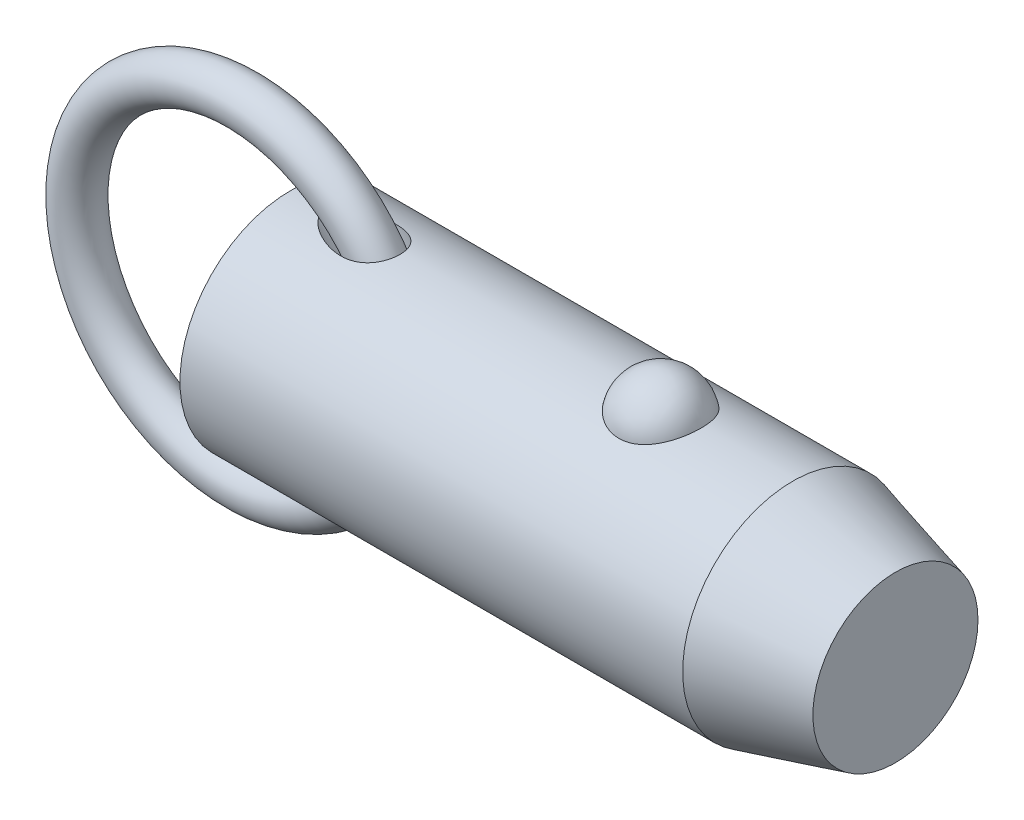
ISO-10303-21;
HEADER;
FILE_DESCRIPTION(('STEP AP214'),'2;1');
FILE_NAME('part.step','',(''),(''),'','','');
FILE_SCHEMA(('AUTOMOTIVE_DESIGN { 1 0 10303 214 1 1 1 1 }'));
ENDSEC;
DATA;
#1=APPLICATION_CONTEXT('core data for automotive mechanical design processes');
#2=APPLICATION_PROTOCOL_DEFINITION('international standard','automotive_design',2000,#1);
#3=PRODUCT_CONTEXT('',#1,'mechanical');
#4=PRODUCT('Part','Part','',(#3));
#5=PRODUCT_RELATED_PRODUCT_CATEGORY('part','',(#4));
#6=PRODUCT_DEFINITION_FORMATION('','',#4);
#7=PRODUCT_DEFINITION_CONTEXT('part definition',#1,'design');
#8=PRODUCT_DEFINITION('design','',#6,#7);
#9=PRODUCT_DEFINITION_SHAPE('','',#8);
#10=(LENGTH_UNIT() NAMED_UNIT(*) SI_UNIT(.MILLI.,.METRE.));
#11=(NAMED_UNIT(*) PLANE_ANGLE_UNIT() SI_UNIT($,.RADIAN.));
#12=(NAMED_UNIT(*) SI_UNIT($,.STERADIAN.) SOLID_ANGLE_UNIT());
#13=UNCERTAINTY_MEASURE_WITH_UNIT(LENGTH_MEASURE(1.E-05),#10,'distance_accuracy_value','');
#14=(GEOMETRIC_REPRESENTATION_CONTEXT(3) GLOBAL_UNCERTAINTY_ASSIGNED_CONTEXT((#13)) GLOBAL_UNIT_ASSIGNED_CONTEXT((#10,
#11,#12)) REPRESENTATION_CONTEXT('',''));
#15=CARTESIAN_POINT('',(0.,0.,0.));
#16=DIRECTION('',(0.,0.,1.));
#17=DIRECTION('',(1.,0.,0.));
#18=AXIS2_PLACEMENT_3D('',#15,#16,#17);
#19=CARTESIAN_POINT('',(-5.53898640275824,0.,0.));
#20=DIRECTION('',(0.,0.,1.));
#21=DIRECTION('',(1.,0.,0.));
#22=AXIS2_PLACEMENT_3D('',#19,#20,#21);
#23=TOROIDAL_SURFACE('',#22,19.05,2.54);
#24=CARTESIAN_POINT('',(16.0510135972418,0.,0.));
#25=VERTEX_POINT('',#24);
#26=VERTEX_LOOP('',#25);
#27=FACE_BOUND('',#26,.T.);
#28=ADVANCED_FACE('P0_F12',(#27),#23,.T.);
#29=CLOSED_SHELL('',(#28));
#30=MANIFOLD_SOLID_BREP('P0_B1',#29);
#31=CARTESIAN_POINT('',(0.,0.,0.));
#32=DIRECTION('',(1.,0.,0.));
#33=DIRECTION('',(0.,0.,-1.));
#34=AXIS2_PLACEMENT_3D('',#31,#32,#33);
#35=CYLINDRICAL_SURFACE('',#34,12.7);
#36=CARTESIAN_POINT('',(58.0007386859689,0.,0.));
#37=DIRECTION('',(1.,0.,0.));
#38=DIRECTION('',(0.,0.,-1.));
#39=AXIS2_PLACEMENT_3D('',#36,#37,#38);
#40=CIRCLE('',#39,12.7);
#41=CARTESIAN_POINT('',(58.0007386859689,0.,-12.7));
#42=VERTEX_POINT('',#41);
#43=EDGE_CURVE('P1_E89',#42,#42,#40,.T.);
#44=ORIENTED_EDGE('',*,*,#43,.F.);
#45=EDGE_LOOP('',(#44));
#46=FACE_BOUND('',#45,.T.);
#47=CARTESIAN_POINT('',(0.,0.,0.));
#48=DIRECTION('',(1.,0.,0.));
#49=DIRECTION('',(0.,0.,-1.));
#50=AXIS2_PLACEMENT_3D('',#47,#48,#49);
#51=CIRCLE('',#50,12.7);
#52=CARTESIAN_POINT('',(0.,0.,-12.7));
#53=VERTEX_POINT('',#52);
#54=EDGE_CURVE('P1_E52',#53,#53,#51,.T.);
#55=ORIENTED_EDGE('',*,*,#54,.T.);
#56=EDGE_LOOP('',(#55));
#57=FACE_BOUND('',#56,.T.);
#58=CARTESIAN_POINT('',(42.7600429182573,11.7500437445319,4.81938502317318));
#59=CARTESIAN_POINT('',(42.6350881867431,11.7500430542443,4.81938571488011));
#60=CARTESIAN_POINT('',(42.510144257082,11.7520975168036,4.81438658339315));
#61=CARTESIAN_POINT('',(42.2611425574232,11.760253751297,4.79442904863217));
#62=CARTESIAN_POINT('',(42.1370850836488,11.7663568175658,4.77946746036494));
#63=CARTESIAN_POINT('',(41.8909016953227,11.7824262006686,4.73971414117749));
#64=CARTESIAN_POINT('',(41.7687744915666,11.7923898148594,4.71492928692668));
#65=CARTESIAN_POINT('',(41.5271874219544,11.8158938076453,4.65571340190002));
#66=CARTESIAN_POINT('',(41.4077285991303,11.8294355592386,4.6212786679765));
#67=CARTESIAN_POINT('',(41.1725578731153,11.8596812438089,4.54309502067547));
#68=CARTESIAN_POINT('',(41.0568393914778,11.8763792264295,4.49936361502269));
#69=CARTESIAN_POINT('',(40.8296530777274,11.9124878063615,4.40287235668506));
#70=CARTESIAN_POINT('',(40.7181868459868,11.9318994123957,4.35010914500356));
#71=CARTESIAN_POINT('',(40.3912782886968,11.9934256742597,4.17881316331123));
#72=CARTESIAN_POINT('',(40.1831270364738,12.038858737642,4.04720756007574));
#73=CARTESIAN_POINT('',(39.7858509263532,12.1352173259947,3.748564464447));
#74=CARTESIAN_POINT('',(39.5974438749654,12.1862630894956,3.58061821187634));
#75=CARTESIAN_POINT('',(39.2505213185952,12.2875163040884,3.21600758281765));
#76=CARTESIAN_POINT('',(39.0920113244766,12.3377235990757,3.0193379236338));
#77=CARTESIAN_POINT('',(38.8016887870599,12.434492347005,2.592916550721));
#78=CARTESIAN_POINT('',(38.6713762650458,12.4807925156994,2.36208286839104));
#79=CARTESIAN_POINT('',(38.4494079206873,12.5623454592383,1.88070399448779));
#80=CARTESIAN_POINT('',(38.3577554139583,12.5975972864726,1.63015711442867));
#81=CARTESIAN_POINT('',(38.2140466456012,12.6538414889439,1.11298869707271));
#82=CARTESIAN_POINT('',(38.1624990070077,12.6746503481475,0.846205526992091));
#83=CARTESIAN_POINT('',(38.1019771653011,12.699153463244,0.307085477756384));
#84=CARTESIAN_POINT('',(38.0930018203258,12.7028481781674,0.0347487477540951));
#85=CARTESIAN_POINT('',(38.1177310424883,12.6927785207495,-0.506073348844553));
#86=CARTESIAN_POINT('',(38.1511899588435,12.6791146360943,-0.774571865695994));
#87=CARTESIAN_POINT('',(38.2596877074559,12.635882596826,-1.30170246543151));
#88=CARTESIAN_POINT('',(38.3347272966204,12.606314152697,-1.5603343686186));
#89=CARTESIAN_POINT('',(38.5250000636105,12.5342328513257,-2.06083899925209));
#90=CARTESIAN_POINT('',(38.6402872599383,12.4917026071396,-2.3026886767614));
#91=CARTESIAN_POINT('',(38.9087044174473,12.3981123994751,-2.76259600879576));
#92=CARTESIAN_POINT('',(39.0618374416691,12.3470517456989,-2.98065173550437));
#93=CARTESIAN_POINT('',(39.4035077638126,12.2416045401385,-3.38786328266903));
#94=CARTESIAN_POINT('',(39.5922017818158,12.1872040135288,-3.57688418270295));
#95=CARTESIAN_POINT('',(40.0002392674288,12.0814086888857,-3.91941073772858));
#96=CARTESIAN_POINT('',(40.2195800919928,12.0300136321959,-4.07291945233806));
#97=CARTESIAN_POINT('',(40.6783753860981,11.9373542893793,-4.33691289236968));
#98=CARTESIAN_POINT('',(40.9173044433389,11.8958982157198,-4.44824125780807));
#99=CARTESIAN_POINT('',(41.4124376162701,11.8268116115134,-4.62881985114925));
#100=CARTESIAN_POINT('',(41.6686351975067,11.7991758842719,-4.69808589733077));
#101=CARTESIAN_POINT('',(42.1771640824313,11.7622209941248,-4.78983181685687));
#102=CARTESIAN_POINT('',(42.4290414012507,11.7520502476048,-4.81449025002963));
#103=CARTESIAN_POINT('',(42.9335734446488,11.7485796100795,-4.82295735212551));
#104=CARTESIAN_POINT('',(43.1862280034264,11.7552763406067,-4.80677420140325));
#105=CARTESIAN_POINT('',(43.6768341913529,11.7842584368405,-4.73525430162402));
#106=CARTESIAN_POINT('',(43.9149984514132,11.8060486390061,-4.68116061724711));
#107=CARTESIAN_POINT('',(44.3784894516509,11.8622750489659,-4.53678133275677));
#108=CARTESIAN_POINT('',(44.6038151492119,11.8967122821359,-4.44649279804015));
#109=CARTESIAN_POINT('',(45.0408018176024,11.9754603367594,-4.2298761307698));
#110=CARTESIAN_POINT('',(45.2520579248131,12.0199699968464,-4.10280539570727));
#111=CARTESIAN_POINT('',(45.6506012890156,12.1138028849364,-3.81685409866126));
#112=CARTESIAN_POINT('',(45.8378830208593,12.163127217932,-3.65796622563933));
#113=CARTESIAN_POINT('',(46.1933509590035,12.2642343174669,-3.30364864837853));
#114=CARTESIAN_POINT('',(46.3601119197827,12.3160165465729,-3.10678783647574));
#115=CARTESIAN_POINT('',(46.6595799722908,12.4142566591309,-2.68748409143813));
#116=CARTESIAN_POINT('',(46.7922809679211,12.4607135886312,-2.46503658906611));
#117=CARTESIAN_POINT('',(47.0246912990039,12.5450236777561,-1.9928951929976));
#118=CARTESIAN_POINT('',(47.123215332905,12.5825557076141,-1.7425591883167));
#119=CARTESIAN_POINT('',(47.2792277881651,12.6431720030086,-1.22773734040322));
#120=CARTESIAN_POINT('',(47.3367157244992,12.6662560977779,-0.963251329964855));
#121=CARTESIAN_POINT('',(47.4095441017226,12.6956486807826,-0.427355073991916));
#122=CARTESIAN_POINT('',(47.4248378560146,12.7019385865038,-0.155937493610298));
#123=CARTESIAN_POINT('',(47.4127794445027,12.6970201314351,0.385928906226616));
#124=CARTESIAN_POINT('',(47.3854280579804,12.6858120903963,0.656377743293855));
#125=CARTESIAN_POINT('',(47.3130609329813,12.6568455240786,1.05454017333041));
#126=CARTESIAN_POINT('',(47.2837963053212,12.6451962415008,1.18577850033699));
#127=CARTESIAN_POINT('',(47.2150228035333,12.6181819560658,1.44513808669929));
#128=CARTESIAN_POINT('',(47.1755176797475,12.6028183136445,1.57326046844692));
#129=CARTESIAN_POINT('',(47.0864397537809,12.5687547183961,1.82554978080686));
#130=CARTESIAN_POINT('',(47.0368627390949,12.5500533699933,1.9497150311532));
#131=CARTESIAN_POINT('',(46.9279211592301,12.5098093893,2.19314370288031));
#132=CARTESIAN_POINT('',(46.8685601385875,12.4882677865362,2.31240887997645));
#133=CARTESIAN_POINT('',(46.7399712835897,12.4427679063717,2.54593031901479));
#134=CARTESIAN_POINT('',(46.6706888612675,12.4187964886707,2.66015396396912));
#135=CARTESIAN_POINT('',(46.522903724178,12.3691892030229,2.88202659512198));
#136=CARTESIAN_POINT('',(46.4444044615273,12.3435539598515,2.98967802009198));
#137=CARTESIAN_POINT('',(46.2785502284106,12.2912955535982,3.19774385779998));
#138=CARTESIAN_POINT('',(46.1911918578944,12.2646720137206,3.29815546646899));
#139=CARTESIAN_POINT('',(46.0081617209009,12.2111945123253,3.49095035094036));
#140=CARTESIAN_POINT('',(45.9124932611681,12.1843406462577,3.58333679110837));
#141=CARTESIAN_POINT('',(45.7136272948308,12.1312249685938,3.75922876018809));
#142=CARTESIAN_POINT('',(45.6104503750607,12.104961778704,3.84275713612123));
#143=CARTESIAN_POINT('',(45.3970133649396,12.0537284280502,4.00056406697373));
#144=CARTESIAN_POINT('',(45.2867562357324,12.028757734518,4.07484645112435));
#145=CARTESIAN_POINT('',(45.0597550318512,11.9808306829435,4.21367959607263));
#146=CARTESIAN_POINT('',(44.9430068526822,11.9578756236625,4.27822410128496));
#147=CARTESIAN_POINT('',(44.7039425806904,11.9147184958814,4.39698483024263));
#148=CARTESIAN_POINT('',(44.5816287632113,11.894515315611,4.45120522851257));
#149=CARTESIAN_POINT('',(44.322952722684,11.8561129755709,4.55255353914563));
#150=CARTESIAN_POINT('',(44.1862237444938,11.8381764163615,4.59884858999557));
#151=CARTESIAN_POINT('',(43.9086087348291,11.8069093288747,4.67853897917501));
#152=CARTESIAN_POINT('',(43.7677245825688,11.7935767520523,4.71194005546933));
#153=CARTESIAN_POINT('',(43.4830944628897,11.7720277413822,4.76552188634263));
#154=CARTESIAN_POINT('',(43.3393488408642,11.7638106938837,4.78570422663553));
#155=CARTESIAN_POINT('',(43.0504114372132,11.7528195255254,4.81263433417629));
#156=CARTESIAN_POINT('',(42.9052198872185,11.7500445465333,4.81938421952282));
#157=CARTESIAN_POINT('',(42.7600429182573,11.7500437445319,4.81938502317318));
#158=B_SPLINE_CURVE_WITH_KNOTS('',3,(#58,#59,#60,#61,#62,#63,#64,#65,#66,#67,#68,#69,#70,#71,
#72,#73,#74,#75,#76,#77,#78,#79,#80,#81,#82,#83,#84,#85,#86,#87,#88,#89,#90,#91,#92,#93,#94,#95,
#96,#97,#98,#99,#100,#101,#102,#103,#104,#105,#106,#107,#108,#109,#110,#111,#112,#113,#114,#115,
#116,#117,#118,#119,#120,#121,#122,#123,#124,#125,#126,#127,#128,#129,#130,#131,#132,#133,#134,
#135,#136,#137,#138,#139,#140,#141,#142,#143,#144,#145,#146,#147,#148,#149,#150,#151,#152,#153,
#154,#155,#156,#157),.UNSPECIFIED.,.T.,.F.,(4,2,2,2,2,2,2,2,2,2,2,2,2,2,2,2,2,2,2,2,2,2,2,2,2,2,
2,2,2,2,2,2,2,2,2,2,2,2,2,2,2,2,2,2,2,2,2,2,2,4),(0.,0.374729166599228,0.749578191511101,
1.12416526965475,1.49889629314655,1.87292776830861,2.24709865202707,2.99481328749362,
3.76399449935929,4.53331735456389,5.3368391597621,6.14042986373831,6.95405296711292,
7.76765424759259,8.57656703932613,9.38549455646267,10.1955119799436,11.0055949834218,
11.8193353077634,12.6330054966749,13.4294141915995,14.2255231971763,14.9815786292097,
15.7374826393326,16.4696948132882,17.2019663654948,17.9501979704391,18.6986017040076,
19.4844704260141,20.2704797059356,21.0815215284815,21.8925729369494,22.7045213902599,
23.5164550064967,23.9209608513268,24.3253187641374,24.7298461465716,25.1342272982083,
25.54092555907,25.9474719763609,26.3541750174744,26.7607169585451,27.1661834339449,
27.5714814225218,27.9770386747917,28.3824315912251,28.8181206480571,29.2536155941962,
29.6890582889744,30.1244323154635),.UNSPECIFIED.);
#159=CARTESIAN_POINT('',(42.7600429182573,11.7500437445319,4.81938502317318));
#160=VERTEX_POINT('',#159);
#161=EDGE_CURVE('P1_E80',#160,#160,#158,.T.);
#162=ORIENTED_EDGE('',*,*,#161,.T.);
#163=EDGE_LOOP('',(#162));
#164=FACE_BOUND('',#163,.T.);
#165=CARTESIAN_POINT('',(-5.53898640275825,0.,0.));
#166=DIRECTION('',(0.796400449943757,-0.604769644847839,0.));
#167=DIRECTION('',(0.604769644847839,0.796400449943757,0.));
#168=AXIS2_PLACEMENT_3D('',#165,#166,#167);
#169=ELLIPSE('',#168,15.9467514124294,12.7);
#170=CARTESIAN_POINT('',(4.0948214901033,12.6864319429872,0.586893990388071));
#171=VERTEX_POINT('',#170);
#172=CARTESIAN_POINT('',(4.0948214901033,12.6864319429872,-0.586893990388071));
#173=VERTEX_POINT('',#172);
#174=EDGE_CURVE('P1_E47',#171,#173,#169,.F.);
#175=ORIENTED_EDGE('',*,*,#174,.T.);
#176=CARTESIAN_POINT('',(4.06153170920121,12.6905758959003,-0.48916605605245));
#177=CARTESIAN_POINT('',(4.08111374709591,12.6881366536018,-0.552489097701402));
#178=CARTESIAN_POINT('',(4.10417851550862,12.6852663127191,-0.614604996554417));
#179=CARTESIAN_POINT('',(4.15628434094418,12.6787965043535,-0.736067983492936));
#180=CARTESIAN_POINT('',(4.18531032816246,12.6751988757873,-0.795421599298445));
#181=CARTESIAN_POINT('',(4.27911159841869,12.6636052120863,-0.967590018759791));
#182=CARTESIAN_POINT('',(4.35123408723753,12.654730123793,-1.07635920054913));
#183=CARTESIAN_POINT('',(4.49106800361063,12.6376715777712,-1.25922957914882));
#184=CARTESIAN_POINT('',(4.55601066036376,12.6297947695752,-1.33556751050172));
#185=CARTESIAN_POINT('',(4.69223626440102,12.6134116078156,-1.4823274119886));
#186=CARTESIAN_POINT('',(4.76352147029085,12.6049050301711,-1.55274725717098));
#187=CARTESIAN_POINT('',(4.91163946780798,12.587417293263,-1.68868704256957));
#188=CARTESIAN_POINT('',(4.98851399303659,12.5784327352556,-1.75416062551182));
#189=CARTESIAN_POINT('',(5.14630057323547,12.560235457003,-1.88003275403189));
#190=CARTESIAN_POINT('',(5.2272139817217,12.5510226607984,-1.94042957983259));
#191=CARTESIAN_POINT('',(5.45368877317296,12.5256514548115,-2.09966332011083));
#192=CARTESIAN_POINT('',(5.60261616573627,12.5094182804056,-2.19371988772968));
#193=CARTESIAN_POINT('',(5.90795545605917,12.4774211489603,-2.36893890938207));
#194=CARTESIAN_POINT('',(6.06437232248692,12.4616575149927,-2.45009264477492));
#195=CARTESIAN_POINT('',(6.38306132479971,12.431227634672,-2.60008249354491));
#196=CARTESIAN_POINT('',(6.54533237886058,12.4165611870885,-2.6689208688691));
#197=CARTESIAN_POINT('',(6.87462618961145,12.3889351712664,-2.79435199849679));
#198=CARTESIAN_POINT('',(7.04164773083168,12.3759751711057,-2.85094785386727));
#199=CARTESIAN_POINT('',(7.38726647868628,12.3518460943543,-2.95377962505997));
#200=CARTESIAN_POINT('',(7.56604577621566,12.3407843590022,-2.99943209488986));
#201=CARTESIAN_POINT('',(7.92698692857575,12.3219309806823,-3.07596683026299));
#202=CARTESIAN_POINT('',(8.10914972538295,12.314140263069,-3.10684491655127));
#203=CARTESIAN_POINT('',(8.47511457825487,12.3025918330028,-3.15226850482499));
#204=CARTESIAN_POINT('',(8.65890979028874,12.2988216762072,-3.16686440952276));
#205=CARTESIAN_POINT('',(9.02696087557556,12.2959421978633,-3.17802250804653));
#206=CARTESIAN_POINT('',(9.2112162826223,12.2968292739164,-3.17459864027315));
#207=CARTESIAN_POINT('',(9.61636263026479,12.3045198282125,-3.14471110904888));
#208=CARTESIAN_POINT('',(9.8369555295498,12.3125080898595,-3.11363232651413));
#209=CARTESIAN_POINT('',(10.1619126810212,12.3303028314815,-3.04206574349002));
#210=CARTESIAN_POINT('',(10.2692747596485,12.3372061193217,-3.01403983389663));
#211=CARTESIAN_POINT('',(10.4811758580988,12.3528538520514,-2.94925947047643));
#212=CARTESIAN_POINT('',(10.5857162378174,12.361597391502,-2.91250930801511));
#213=CARTESIAN_POINT('',(10.792132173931,12.3808585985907,-2.82951748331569));
#214=CARTESIAN_POINT('',(10.8939665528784,12.3913944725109,-2.78317723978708));
#215=CARTESIAN_POINT('',(11.092611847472,12.4138762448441,-2.68112002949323));
#216=CARTESIAN_POINT('',(11.1894254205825,12.4258213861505,-2.62540809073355));
#217=CARTESIAN_POINT('',(11.3768740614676,12.4507225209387,-2.50465655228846));
#218=CARTESIAN_POINT('',(11.4675115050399,12.4636781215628,-2.43962056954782));
#219=CARTESIAN_POINT('',(11.6414572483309,12.4901070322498,-2.30048560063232));
#220=CARTESIAN_POINT('',(11.7247669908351,12.5035802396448,-2.22638840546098));
#221=CARTESIAN_POINT('',(11.8713131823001,12.5285000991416,-2.08117367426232));
#222=CARTESIAN_POINT('',(11.9357009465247,12.5399538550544,-2.01121596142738));
#223=CARTESIAN_POINT('',(12.0576805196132,12.5624496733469,-1.86555293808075));
#224=CARTESIAN_POINT('',(12.1152732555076,12.5734917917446,-1.78984841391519));
#225=CARTESIAN_POINT('',(12.223073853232,12.5947858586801,-1.63327883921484));
#226=CARTESIAN_POINT('',(12.2732844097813,12.6050380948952,-1.55241568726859));
#227=CARTESIAN_POINT('',(12.3658430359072,12.6243983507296,-1.38621267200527));
#228=CARTESIAN_POINT('',(12.4081916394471,12.6335064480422,-1.30087311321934));
#229=CARTESIAN_POINT('',(12.5150098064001,12.6569076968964,-1.05702619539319));
#230=CARTESIAN_POINT('',(12.5703399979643,12.6695746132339,-0.894232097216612));
#231=CARTESIAN_POINT('',(12.6526225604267,12.6886816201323,-0.561391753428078));
#232=CARTESIAN_POINT('',(12.6795825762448,12.6951233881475,-0.391347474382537));
#233=CARTESIAN_POINT('',(12.7041016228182,12.7009766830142,-0.0537636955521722));
#234=CARTESIAN_POINT('',(12.7024538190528,12.7005778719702,0.113714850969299));
#235=CARTESIAN_POINT('',(12.6717240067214,12.6932548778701,0.445979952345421));
#236=CARTESIAN_POINT('',(12.6426435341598,12.6863310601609,0.610766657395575));
#237=CARTESIAN_POINT('',(12.5579769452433,12.6667465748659,0.932429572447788));
#238=CARTESIAN_POINT('',(12.5024793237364,12.6541050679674,1.08933027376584));
#239=CARTESIAN_POINT('',(12.3665691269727,12.6244558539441,1.39146752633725));
#240=CARTESIAN_POINT('',(12.2861577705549,12.6074483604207,1.53670464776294));
#241=CARTESIAN_POINT('',(12.1018203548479,12.5706804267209,1.81319588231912));
#242=CARTESIAN_POINT('',(11.9976588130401,12.5508932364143,1.94428915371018));
#243=CARTESIAN_POINT('',(11.7695265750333,12.5107540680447,2.18776051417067));
#244=CARTESIAN_POINT('',(11.6455540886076,12.4904020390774,2.30013691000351));
#245=CARTESIAN_POINT('',(11.3759347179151,12.4502278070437,2.50870972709));
#246=CARTESIAN_POINT('',(11.2295880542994,12.4304654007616,2.60400962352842));
#247=CARTESIAN_POINT('',(10.9239803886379,12.3941696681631,2.77162929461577));
#248=CARTESIAN_POINT('',(10.7647152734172,12.3776373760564,2.84394171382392));
#249=CARTESIAN_POINT('',(10.4192039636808,12.3473062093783,2.97303525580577));
#250=CARTESIAN_POINT('',(10.2319332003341,12.3340204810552,3.027171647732));
#251=CARTESIAN_POINT('',(9.85152982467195,12.3134301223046,3.10986173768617));
#252=CARTESIAN_POINT('',(9.65839336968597,12.3061295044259,3.13839827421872));
#253=CARTESIAN_POINT('',(9.31022514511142,12.2982822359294,3.16897517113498));
#254=CARTESIAN_POINT('',(9.15555718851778,12.2966525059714,3.17526894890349));
#255=CARTESIAN_POINT('',(8.8461894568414,12.2967963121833,3.17471335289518));
#256=CARTESIAN_POINT('',(8.69148970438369,12.2985715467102,3.16785742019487));
#257=CARTESIAN_POINT('',(8.38280471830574,12.3051648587,3.14214692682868));
#258=CARTESIAN_POINT('',(8.22882218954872,12.3099904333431,3.12326280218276));
#259=CARTESIAN_POINT('',(7.92276070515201,12.3222644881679,3.07448013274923));
#260=CARTESIAN_POINT('',(7.77068148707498,12.3297126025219,3.04458312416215));
#261=CARTESIAN_POINT('',(7.46452663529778,12.3470493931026,2.97350781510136));
#262=CARTESIAN_POINT('',(7.31052714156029,12.3570043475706,2.93201910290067));
#263=CARTESIAN_POINT('',(7.00579083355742,12.3787609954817,2.83876185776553));
#264=CARTESIAN_POINT('',(6.85505451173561,12.3905629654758,2.7869917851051));
#265=CARTESIAN_POINT('',(6.55781208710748,12.415528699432,2.67357744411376));
#266=CARTESIAN_POINT('',(6.41129783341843,12.4286895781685,2.61195394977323));
#267=CARTESIAN_POINT('',(6.12302950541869,12.4559398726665,2.47874512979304));
#268=CARTESIAN_POINT('',(5.98127390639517,12.4700289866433,2.40716303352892));
#269=CARTESIAN_POINT('',(5.67073126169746,12.5020754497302,2.2355042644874));
#270=CARTESIAN_POINT('',(5.50343839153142,12.5201625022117,2.13268685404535));
#271=CARTESIAN_POINT('',(5.26147616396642,12.5471537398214,1.96522579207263));
#272=CARTESIAN_POINT('',(5.18224299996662,12.5561365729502,1.90713440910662));
#273=CARTESIAN_POINT('',(5.0274647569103,12.573912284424,1.78618989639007));
#274=CARTESIAN_POINT('',(4.95191912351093,12.5827051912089,1.72333748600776));
#275=CARTESIAN_POINT('',(4.81787163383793,12.598469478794,1.60360864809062));
#276=CARTESIAN_POINT('',(4.75865966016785,12.6054958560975,1.54753994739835));
#277=CARTESIAN_POINT('',(4.64406285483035,12.6191906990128,1.43158546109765));
#278=CARTESIAN_POINT('',(4.58867926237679,12.6258590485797,1.37169845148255));
#279=CARTESIAN_POINT('',(4.43014912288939,12.6450546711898,1.18656670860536));
#280=CARTESIAN_POINT('',(4.33372726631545,12.6568788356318,1.05507993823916));
#281=CARTESIAN_POINT('',(4.21252055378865,12.6718304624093,0.848052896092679));
#282=CARTESIAN_POINT('',(4.17660155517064,12.6762773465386,0.779100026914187));
#283=CARTESIAN_POINT('',(4.11264979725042,12.6842122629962,0.63708048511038));
#284=CARTESIAN_POINT('',(4.08466792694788,12.6876941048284,0.56399071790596));
#285=CARTESIAN_POINT('',(4.0615317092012,12.6905758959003,0.489166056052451));
#286=B_SPLINE_CURVE_WITH_KNOTS('',3,(#176,#177,#178,#179,#180,#181,#182,#183,#184,#185,#186,
#187,#188,#189,#190,#191,#192,#193,#194,#195,#196,#197,#198,#199,#200,#201,#202,#203,#204,#205,
#206,#207,#208,#209,#210,#211,#212,#213,#214,#215,#216,#217,#218,#219,#220,#221,#222,#223,#224,
#225,#226,#227,#228,#229,#230,#231,#232,#233,#234,#235,#236,#237,#238,#239,#240,#241,#242,#243,
#244,#245,#246,#247,#248,#249,#250,#251,#252,#253,#254,#255,#256,#257,#258,#259,#260,#261,#262,
#263,#264,#265,#266,#267,#268,#269,#270,#271,#272,#273,#274,#275,#276,#277,#278,#279,#280,#281,
#282,#283,#284,#285),.UNSPECIFIED.,.F.,.F.,(4,2,2,2,2,2,2,2,2,2,2,2,2,2,2,2,2,2,2,2,2,2,2,2,2,2,
2,2,2,2,2,2,2,2,2,2,2,2,2,2,2,2,2,2,2,2,2,2,2,2,2,2,2,2,4),(0.,0.198708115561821,
0.39691995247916,0.787580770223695,1.08882492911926,1.39017679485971,1.69407136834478,
1.9980684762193,2.52793143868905,3.05815092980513,3.58827293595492,4.11826050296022,
4.67218806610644,5.22627222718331,5.77863637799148,6.33057333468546,6.99657211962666,
7.3297741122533,7.66281254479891,7.99946156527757,8.33593054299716,8.67226935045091,
9.00854178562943,9.29544181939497,9.58230266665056,9.86905853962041,10.155794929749,
10.670233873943,11.184534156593,11.6845985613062,12.1846349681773,12.6830079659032,
13.1813565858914,13.6848795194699,14.1884479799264,14.713533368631,15.2387866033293,
15.8228373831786,16.4072794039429,16.8710810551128,17.3351141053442,17.8002921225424,
18.2654052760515,18.7444169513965,19.2235004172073,19.7015868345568,20.1795185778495,
20.7699825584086,21.0658110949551,21.361595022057,21.6069574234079,21.8523988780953,
22.3397467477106,22.5729183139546,22.8075527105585),.UNSPECIFIED.);
#287=EDGE_CURVE('P1_E51',#173,#171,#286,.T.);
#288=ORIENTED_EDGE('',*,*,#287,.T.);
#289=EDGE_LOOP('',(#175,#288));
#290=FACE_BOUND('',#289,.T.);
#291=CARTESIAN_POINT('',(-5.53898640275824,0.,0.));
#292=DIRECTION('',(-0.796400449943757,-0.604769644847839,0.));
#293=DIRECTION('',(0.604769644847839,-0.796400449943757,0.));
#294=AXIS2_PLACEMENT_3D('',#291,#292,#293);
#295=ELLIPSE('',#294,15.9467514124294,12.7);
#296=CARTESIAN_POINT('',(4.09482149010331,-12.6864319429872,0.586893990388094));
#297=VERTEX_POINT('',#296);
#298=CARTESIAN_POINT('',(4.09482149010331,-12.6864319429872,-0.586893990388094));
#299=VERTEX_POINT('',#298);
#300=EDGE_CURVE('P1_E28',#297,#299,#295,.F.);
#301=ORIENTED_EDGE('',*,*,#300,.F.);
#302=CARTESIAN_POINT('',(4.06153170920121,-12.6905758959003,0.489166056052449));
#303=CARTESIAN_POINT('',(4.08111374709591,-12.6881366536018,0.552489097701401));
#304=CARTESIAN_POINT('',(4.10417851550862,-12.6852663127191,0.614604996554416));
#305=CARTESIAN_POINT('',(4.15628434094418,-12.6787965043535,0.736067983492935));
#306=CARTESIAN_POINT('',(4.18531032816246,-12.6751988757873,0.795421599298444));
#307=CARTESIAN_POINT('',(4.27911159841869,-12.6636052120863,0.967590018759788));
#308=CARTESIAN_POINT('',(4.35123408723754,-12.654730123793,1.07635920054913));
#309=CARTESIAN_POINT('',(4.49106800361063,-12.6376715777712,1.25922957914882));
#310=CARTESIAN_POINT('',(4.55601066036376,-12.6297947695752,1.33556751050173));
#311=CARTESIAN_POINT('',(4.69223626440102,-12.6134116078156,1.4823274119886));
#312=CARTESIAN_POINT('',(4.76352147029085,-12.6049050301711,1.55274725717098));
#313=CARTESIAN_POINT('',(4.91163946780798,-12.587417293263,1.68868704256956));
#314=CARTESIAN_POINT('',(4.98851399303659,-12.5784327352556,1.75416062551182));
#315=CARTESIAN_POINT('',(5.14630057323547,-12.560235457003,1.88003275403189));
#316=CARTESIAN_POINT('',(5.2272139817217,-12.5510226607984,1.94042957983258));
#317=CARTESIAN_POINT('',(5.45368877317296,-12.5256514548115,2.09966332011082));
#318=CARTESIAN_POINT('',(5.60261616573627,-12.5094182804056,2.19371988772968));
#319=CARTESIAN_POINT('',(5.90795545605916,-12.4774211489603,2.36893890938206));
#320=CARTESIAN_POINT('',(6.06437232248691,-12.4616575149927,2.45009264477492));
#321=CARTESIAN_POINT('',(6.3830613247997,-12.431227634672,2.6000824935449));
#322=CARTESIAN_POINT('',(6.54533237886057,-12.4165611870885,2.66892086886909));
#323=CARTESIAN_POINT('',(6.87462618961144,-12.3889351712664,2.79435199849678));
#324=CARTESIAN_POINT('',(7.04164773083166,-12.3759751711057,2.85094785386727));
#325=CARTESIAN_POINT('',(7.38726647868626,-12.3518460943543,2.95377962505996));
#326=CARTESIAN_POINT('',(7.56604577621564,-12.3407843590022,2.99943209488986));
#327=CARTESIAN_POINT('',(7.92698692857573,-12.3219309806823,3.07596683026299));
#328=CARTESIAN_POINT('',(8.10914972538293,-12.314140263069,3.10684491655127));
#329=CARTESIAN_POINT('',(8.47511457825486,-12.3025918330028,3.15226850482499));
#330=CARTESIAN_POINT('',(8.65890979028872,-12.2988216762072,3.16686440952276));
#331=CARTESIAN_POINT('',(9.02696087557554,-12.2959421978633,3.17802250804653));
#332=CARTESIAN_POINT('',(9.21121628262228,-12.2968292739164,3.17459864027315));
#333=CARTESIAN_POINT('',(9.61636263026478,-12.3045198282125,3.14471110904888));
#334=CARTESIAN_POINT('',(9.83695552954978,-12.3125080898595,3.11363232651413));
#335=CARTESIAN_POINT('',(10.1619126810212,-12.3303028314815,3.04206574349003));
#336=CARTESIAN_POINT('',(10.2692747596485,-12.3372061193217,3.01403983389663));
#337=CARTESIAN_POINT('',(10.4811758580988,-12.3528538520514,2.94925947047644));
#338=CARTESIAN_POINT('',(10.5857162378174,-12.361597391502,2.91250930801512));
#339=CARTESIAN_POINT('',(10.792132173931,-12.3808585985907,2.8295174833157));
#340=CARTESIAN_POINT('',(10.8939665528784,-12.3913944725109,2.78317723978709));
#341=CARTESIAN_POINT('',(11.092611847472,-12.4138762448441,2.68112002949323));
#342=CARTESIAN_POINT('',(11.1894254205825,-12.4258213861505,2.62540809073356));
#343=CARTESIAN_POINT('',(11.3768740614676,-12.4507225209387,2.50465655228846));
#344=CARTESIAN_POINT('',(11.4675115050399,-12.4636781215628,2.43962056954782));
#345=CARTESIAN_POINT('',(11.6414572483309,-12.4901070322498,2.30048560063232));
#346=CARTESIAN_POINT('',(11.7247669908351,-12.5035802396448,2.22638840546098));
#347=CARTESIAN_POINT('',(11.8713131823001,-12.5285000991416,2.08117367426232));
#348=CARTESIAN_POINT('',(11.9357009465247,-12.5399538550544,2.01121596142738));
#349=CARTESIAN_POINT('',(12.0576805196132,-12.5624496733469,1.86555293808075));
#350=CARTESIAN_POINT('',(12.1152732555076,-12.5734917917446,1.78984841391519));
#351=CARTESIAN_POINT('',(12.223073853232,-12.5947858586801,1.63327883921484));
#352=CARTESIAN_POINT('',(12.2732844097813,-12.6050380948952,1.55241568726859));
#353=CARTESIAN_POINT('',(12.3658430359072,-12.6243983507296,1.38621267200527));
#354=CARTESIAN_POINT('',(12.4081916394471,-12.6335064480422,1.30087311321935));
#355=CARTESIAN_POINT('',(12.5150098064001,-12.6569076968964,1.05702619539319));
#356=CARTESIAN_POINT('',(12.5703399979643,-12.6695746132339,0.894232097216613));
#357=CARTESIAN_POINT('',(12.6526225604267,-12.6886816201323,0.561391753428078));
#358=CARTESIAN_POINT('',(12.6795825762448,-12.6951233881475,0.391347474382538));
#359=CARTESIAN_POINT('',(12.7041016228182,-12.7009766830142,0.0537636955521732));
#360=CARTESIAN_POINT('',(12.7024538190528,-12.7005778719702,-0.113714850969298));
#361=CARTESIAN_POINT('',(12.6717240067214,-12.6932548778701,-0.44597995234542));
#362=CARTESIAN_POINT('',(12.6426435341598,-12.6863310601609,-0.610766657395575));
#363=CARTESIAN_POINT('',(12.5579769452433,-12.6667465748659,-0.932429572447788));
#364=CARTESIAN_POINT('',(12.5024793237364,-12.6541050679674,-1.08933027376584));
#365=CARTESIAN_POINT('',(12.3665691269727,-12.6244558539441,-1.39146752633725));
#366=CARTESIAN_POINT('',(12.2861577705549,-12.6074483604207,-1.53670464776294));
#367=CARTESIAN_POINT('',(12.1018203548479,-12.5706804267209,-1.81319588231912));
#368=CARTESIAN_POINT('',(11.9976588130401,-12.5508932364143,-1.94428915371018));
#369=CARTESIAN_POINT('',(11.7695265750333,-12.5107540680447,-2.18776051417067));
#370=CARTESIAN_POINT('',(11.6455540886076,-12.4904020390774,-2.30013691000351));
#371=CARTESIAN_POINT('',(11.3759347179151,-12.4502278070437,-2.50870972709));
#372=CARTESIAN_POINT('',(11.2295880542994,-12.4304654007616,-2.60400962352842));
#373=CARTESIAN_POINT('',(10.9239803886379,-12.3941696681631,-2.77162929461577));
#374=CARTESIAN_POINT('',(10.7647152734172,-12.3776373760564,-2.84394171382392));
#375=CARTESIAN_POINT('',(10.4192039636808,-12.3473062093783,-2.97303525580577));
#376=CARTESIAN_POINT('',(10.2319332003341,-12.3340204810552,-3.027171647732));
#377=CARTESIAN_POINT('',(9.85152982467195,-12.3134301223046,-3.10986173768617));
#378=CARTESIAN_POINT('',(9.65839336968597,-12.3061295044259,-3.13839827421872));
#379=CARTESIAN_POINT('',(9.31022514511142,-12.2982822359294,-3.16897517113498));
#380=CARTESIAN_POINT('',(9.15555718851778,-12.2966525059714,-3.17526894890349));
#381=CARTESIAN_POINT('',(8.8461894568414,-12.2967963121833,-3.17471335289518));
#382=CARTESIAN_POINT('',(8.69148970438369,-12.2985715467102,-3.16785742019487));
#383=CARTESIAN_POINT('',(8.38280471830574,-12.3051648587,-3.14214692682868));
#384=CARTESIAN_POINT('',(8.22882218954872,-12.3099904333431,-3.12326280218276));
#385=CARTESIAN_POINT('',(7.92276070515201,-12.3222644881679,-3.07448013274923));
#386=CARTESIAN_POINT('',(7.77068148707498,-12.3297126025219,-3.04458312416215));
#387=CARTESIAN_POINT('',(7.46452663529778,-12.3470493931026,-2.97350781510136));
#388=CARTESIAN_POINT('',(7.31052714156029,-12.3570043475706,-2.93201910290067));
#389=CARTESIAN_POINT('',(7.00579083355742,-12.3787609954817,-2.83876185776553));
#390=CARTESIAN_POINT('',(6.85505451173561,-12.3905629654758,-2.7869917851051));
#391=CARTESIAN_POINT('',(6.55781208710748,-12.415528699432,-2.67357744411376));
#392=CARTESIAN_POINT('',(6.41129783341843,-12.4286895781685,-2.61195394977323));
#393=CARTESIAN_POINT('',(6.12302950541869,-12.4559398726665,-2.47874512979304));
#394=CARTESIAN_POINT('',(5.98127390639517,-12.4700289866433,-2.40716303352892));
#395=CARTESIAN_POINT('',(5.67073126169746,-12.5020754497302,-2.2355042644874));
#396=CARTESIAN_POINT('',(5.50343839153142,-12.5201625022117,-2.13268685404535));
#397=CARTESIAN_POINT('',(5.26147616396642,-12.5471537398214,-1.96522579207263));
#398=CARTESIAN_POINT('',(5.18224299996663,-12.5561365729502,-1.90713440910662));
#399=CARTESIAN_POINT('',(5.0274647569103,-12.573912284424,-1.78618989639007));
#400=CARTESIAN_POINT('',(4.95191912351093,-12.5827051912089,-1.72333748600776));
#401=CARTESIAN_POINT('',(4.81787163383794,-12.598469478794,-1.60360864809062));
#402=CARTESIAN_POINT('',(4.75865966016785,-12.6054958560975,-1.54753994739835));
#403=CARTESIAN_POINT('',(4.64406285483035,-12.6191906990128,-1.43158546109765));
#404=CARTESIAN_POINT('',(4.58867926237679,-12.6258590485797,-1.37169845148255));
#405=CARTESIAN_POINT('',(4.43014912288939,-12.6450546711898,-1.18656670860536));
#406=CARTESIAN_POINT('',(4.33372726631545,-12.6568788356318,-1.05507993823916));
#407=CARTESIAN_POINT('',(4.21252055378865,-12.6718304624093,-0.848052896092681));
#408=CARTESIAN_POINT('',(4.17660155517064,-12.6762773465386,-0.779100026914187));
#409=CARTESIAN_POINT('',(4.11264979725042,-12.6842122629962,-0.637080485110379));
#410=CARTESIAN_POINT('',(4.08466792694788,-12.6876941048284,-0.563990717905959));
#411=CARTESIAN_POINT('',(4.06153170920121,-12.6905758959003,-0.48916605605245));
#412=B_SPLINE_CURVE_WITH_KNOTS('',3,(#302,#303,#304,#305,#306,#307,#308,#309,#310,#311,#312,
#313,#314,#315,#316,#317,#318,#319,#320,#321,#322,#323,#324,#325,#326,#327,#328,#329,#330,#331,
#332,#333,#334,#335,#336,#337,#338,#339,#340,#341,#342,#343,#344,#345,#346,#347,#348,#349,#350,
#351,#352,#353,#354,#355,#356,#357,#358,#359,#360,#361,#362,#363,#364,#365,#366,#367,#368,#369,
#370,#371,#372,#373,#374,#375,#376,#377,#378,#379,#380,#381,#382,#383,#384,#385,#386,#387,#388,
#389,#390,#391,#392,#393,#394,#395,#396,#397,#398,#399,#400,#401,#402,#403,#404,#405,#406,#407,
#408,#409,#410,#411),.UNSPECIFIED.,.F.,.F.,(4,2,2,2,2,2,2,2,2,2,2,2,2,2,2,2,2,2,2,2,2,2,2,2,2,2,
2,2,2,2,2,2,2,2,2,2,2,2,2,2,2,2,2,2,2,2,2,2,2,2,2,2,2,2,4),(0.,0.198708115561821,
0.39691995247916,0.787580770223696,1.08882492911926,1.39017679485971,1.69407136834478,
1.9980684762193,2.52793143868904,3.05815092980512,3.58827293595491,4.11826050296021,
4.67218806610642,5.22627222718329,5.77863637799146,6.33057333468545,6.99657211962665,
7.32977411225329,7.6628125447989,7.99946156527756,8.33593054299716,8.67226935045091,
9.00854178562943,9.29544181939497,9.58230266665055,9.86905853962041,10.155794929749,
10.670233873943,11.184534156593,11.6845985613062,12.1846349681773,12.6830079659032,
13.1813565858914,13.6848795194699,14.1884479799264,14.713533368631,15.2387866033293,
15.8228373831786,16.4072794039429,16.8710810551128,17.3351141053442,17.8002921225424,
18.2654052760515,18.7444169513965,19.2235004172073,19.7015868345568,20.1795185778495,
20.7699825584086,21.0658110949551,21.361595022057,21.6069574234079,21.8523988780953,
22.3397467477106,22.5729183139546,22.8075527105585),.UNSPECIFIED.);
#413=EDGE_CURVE('P1_E10',#297,#299,#412,.T.);
#414=ORIENTED_EDGE('',*,*,#413,.T.);
#415=EDGE_LOOP('',(#301,#414));
#416=FACE_BOUND('',#415,.T.);
#417=ADVANCED_FACE('P1_F15',(#46,#57,#164,#290,#416),#35,.T.);
#418=CARTESIAN_POINT('',(0.,0.,0.));
#419=DIRECTION('',(-1.,0.,0.));
#420=DIRECTION('',(0.,0.,1.));
#421=AXIS2_PLACEMENT_3D('',#418,#419,#420);
#422=PLANE('',#421);
#423=ORIENTED_EDGE('',*,*,#54,.F.);
#424=EDGE_LOOP('',(#423));
#425=FACE_BOUND('',#424,.T.);
#426=ADVANCED_FACE('P1_F17',(#425),#422,.T.);
#427=CARTESIAN_POINT('',(69.85,0.,0.));
#428=DIRECTION('',(-1.,0.,0.));
#429=DIRECTION('',(0.,0.,1.));
#430=AXIS2_PLACEMENT_3D('',#427,#428,#429);
#431=CONICAL_SURFACE('',#430,9.52500000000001,0.26179938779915);
#432=ORIENTED_EDGE('',*,*,#43,.T.);
#433=EDGE_LOOP('',(#432));
#434=FACE_BOUND('',#433,.T.);
#435=CARTESIAN_POINT('',(69.85,0.,0.));
#436=DIRECTION('',(1.,0.,0.));
#437=DIRECTION('',(0.,0.,-1.));
#438=AXIS2_PLACEMENT_3D('',#435,#436,#437);
#439=CIRCLE('',#438,9.52500000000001);
#440=CARTESIAN_POINT('',(69.85,0.,-9.52500000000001));
#441=VERTEX_POINT('',#440);
#442=EDGE_CURVE('P1_E86',#441,#441,#439,.T.);
#443=ORIENTED_EDGE('',*,*,#442,.F.);
#444=EDGE_LOOP('',(#443));
#445=FACE_BOUND('',#444,.T.);
#446=ADVANCED_FACE('P1_F105',(#434,#445),#431,.T.);
#447=CARTESIAN_POINT('',(69.85,9.52500000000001,0.));
#448=DIRECTION('',(1.,0.,0.));
#449=DIRECTION('',(0.,0.,-1.));
#450=AXIS2_PLACEMENT_3D('',#447,#448,#449);
#451=PLANE('',#450);
#452=ORIENTED_EDGE('',*,*,#442,.T.);
#453=EDGE_LOOP('',(#452));
#454=FACE_BOUND('',#453,.T.);
#455=ADVANCED_FACE('P1_F78',(#454),#451,.T.);
#456=CARTESIAN_POINT('',(42.7600429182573,11.43,0.));
#457=DIRECTION('',(-1.,0.,0.));
#458=DIRECTION('',(0.,-1.,0.));
#459=AXIS2_PLACEMENT_3D('',#456,#457,#458);
#460=SPHERICAL_SURFACE('',#459,4.83);
#461=ORIENTED_EDGE('',*,*,#161,.F.);
#462=EDGE_LOOP('',(#461));
#463=FACE_BOUND('',#462,.T.);
#464=ADVANCED_FACE('P1_F71',(#463),#460,.T.);
#465=CARTESIAN_POINT('',(-5.53898640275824,0.,0.));
#466=DIRECTION('',(0.,0.,1.));
#467=DIRECTION('',(1.,0.,0.));
#468=AXIS2_PLACEMENT_3D('',#465,#466,#467);
#469=TOROIDAL_SURFACE('',#468,19.05,3.175);
#470=CARTESIAN_POINT('',(5.9818753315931,-15.1714285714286,0.));
#471=DIRECTION('',(-0.796400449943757,-0.604769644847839,0.));
#472=DIRECTION('',(0.604769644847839,-0.796400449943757,0.));
#473=AXIS2_PLACEMENT_3D('',#470,#471,#472);
#474=CIRCLE('',#473,3.175);
#475=EDGE_CURVE('P1_E34',#297,#299,#474,.T.);
#476=ORIENTED_EDGE('',*,*,#475,.T.);
#477=ORIENTED_EDGE('',*,*,#413,.F.);
#478=EDGE_LOOP('',(#476,#477));
#479=FACE_BOUND('',#478,.T.);
#480=CARTESIAN_POINT('',(5.9818753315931,15.1714285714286,0.));
#481=DIRECTION('',(0.796400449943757,-0.604769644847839,0.));
#482=DIRECTION('',(0.604769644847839,0.796400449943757,0.));
#483=AXIS2_PLACEMENT_3D('',#480,#481,#482);
#484=CIRCLE('',#483,3.175);
#485=EDGE_CURVE('P1_E41',#171,#173,#484,.T.);
#486=ORIENTED_EDGE('',*,*,#485,.F.);
#487=ORIENTED_EDGE('',*,*,#287,.F.);
#488=EDGE_LOOP('',(#486,#487));
#489=FACE_BOUND('',#488,.T.);
#490=ADVANCED_FACE('P1_F55',(#479,#489),#469,.F.);
#491=CARTESIAN_POINT('',(5.9818753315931,-15.1714285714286,0.));
#492=DIRECTION('',(-0.796400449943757,-0.604769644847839,0.));
#493=DIRECTION('',(0.604769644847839,-0.796400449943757,0.));
#494=AXIS2_PLACEMENT_3D('',#491,#492,#493);
#495=PLANE('',#494);
#496=ORIENTED_EDGE('',*,*,#300,.T.);
#497=ORIENTED_EDGE('',*,*,#475,.F.);
#498=EDGE_LOOP('',(#496,#497));
#499=FACE_BOUND('',#498,.T.);
#500=ADVANCED_FACE('P1_F70',(#499),#495,.F.);
#501=CARTESIAN_POINT('',(5.9818753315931,15.1714285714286,0.));
#502=DIRECTION('',(0.796400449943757,-0.604769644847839,0.));
#503=DIRECTION('',(0.604769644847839,0.796400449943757,0.));
#504=AXIS2_PLACEMENT_3D('',#501,#502,#503);
#505=PLANE('',#504);
#506=ORIENTED_EDGE('',*,*,#485,.T.);
#507=ORIENTED_EDGE('',*,*,#174,.F.);
#508=EDGE_LOOP('',(#506,#507));
#509=FACE_BOUND('',#508,.T.);
#510=ADVANCED_FACE('P1_F48',(#509),#505,.T.);
#511=CLOSED_SHELL('',(#417,#426,#446,#455,#464,#490,#500,#510));
#512=MANIFOLD_SOLID_BREP('P1_B1',#511);
#513=ADVANCED_BREP_SHAPE_REPRESENTATION('',(#18,#30,#512),#14);
#514=SHAPE_DEFINITION_REPRESENTATION(#9,#513);
ENDSEC;
END-ISO-10303-21;
